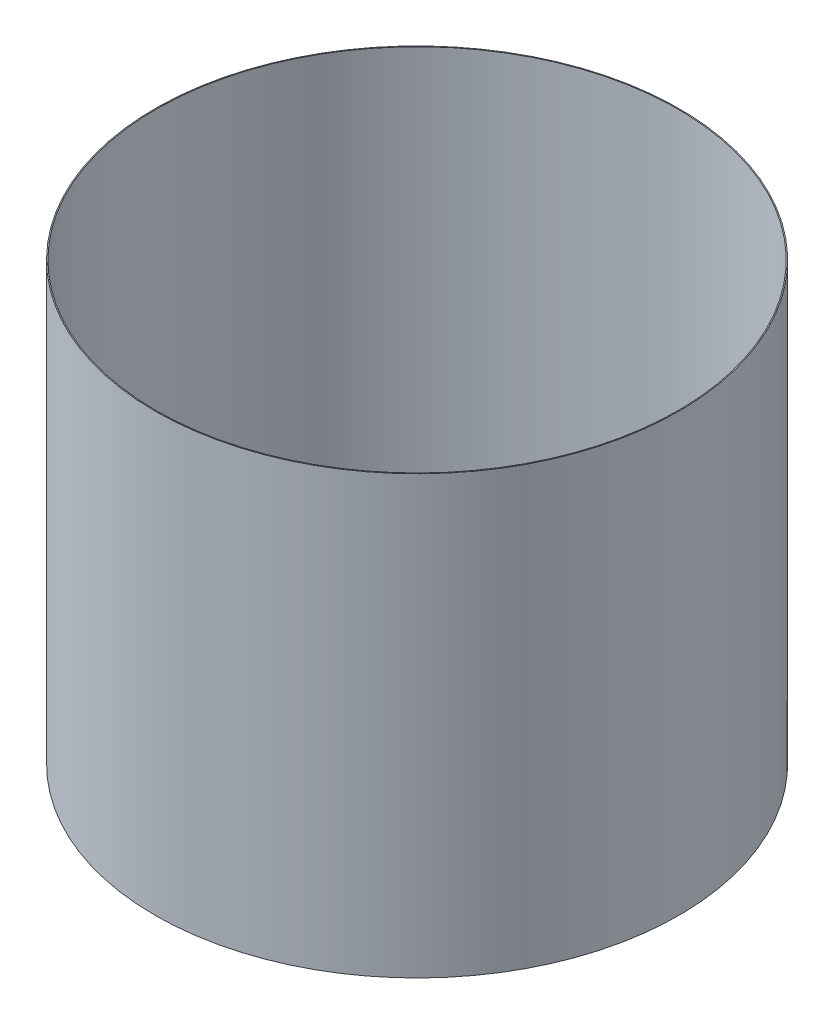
from build123d import *

# Parameters (mm, degrees)
SKETCH1_R           = 33
BOSS_EXTRUDE1_DEPTH = 55
SHELL1_T            = -0.12


with BuildPart() as part:
    # Sketch1 → Boss-Extrude1 (new body)
    with BuildSketch(Plane(origin=(0, 0, 0), x_dir=(1, 0, 0), z_dir=(0, 1, 0))):
        with Locations(Location((0, 0, 0), (0, 0, 270))):
            Circle(SKETCH1_R)
    extrude(amount=BOSS_EXTRUDE1_DEPTH)

    # Shell1
    shell1_openings = [part.faces().sort_by_distance(p)[0] for p in [
        (0, 55, 0),
    ]]
    offset(amount=SHELL1_T, openings=shell1_openings, kind=Kind.INTERSECTION)


solid = part.part
